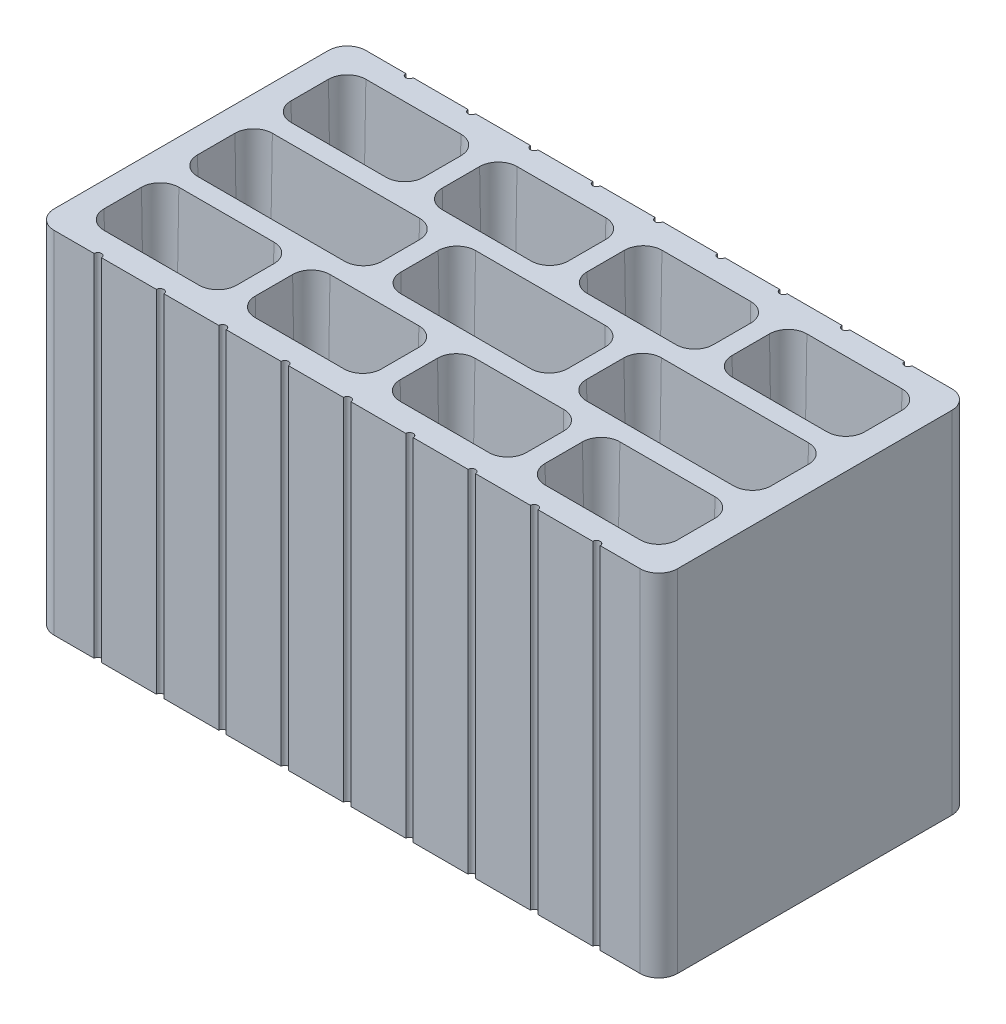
from build123d import *

# Parameters (mm, degrees)
BOSS_EXTRU_1_DEPTH = 28.125
D_POUILLE1_ANGLE   = 1


with BuildPart() as part:
    # Esquisse1 → Boss.-Extru.1 (new body)
    with BuildSketch(Plane(origin=(0, 0, 0), x_dir=(1, 0, 0), z_dir=(0, 1, 0))):
        with BuildLine():
            Line((1.5, 0), (4.7, 0))
            ThreePointArc((4.7, 0), (5, 0.3), (5.3, 0))
            Line((5.3, 0), (9.7, 0))
            ThreePointArc((9.7, 0), (10, 0.3), (10.3, 0))
            Line((10.3, 0), (14.7, 0))
            ThreePointArc((14.7, 0), (15, 0.3), (15.3, 0))
            Line((15.3, 0), (19.7, 0))
            ThreePointArc((19.7, 0), (20, 0.3), (20.3, 0))
            Line((20.3, 0), (24.7, 0))
            ThreePointArc((24.7, 0), (25, 0.3), (25.3, 0))
            Line((25.3, 0), (29.7, 0))
            ThreePointArc((29.7, 0), (30, 0.3), (30.3, 0))
            Line((30.3, 0), (34.7, 0))
            ThreePointArc((34.7, 0), (35, 0.3), (35.3, 0))
            Line((35.3, 0), (39.7, 0))
            ThreePointArc((39.7, 0), (40, 0.3), (40.3, 0))
            Line((40.3, 0), (44.7, 0))
            ThreePointArc((44.7, 0), (45, 0.3), (45.3, 0))
            Line((45.3, 0), (48.5, 0))
            ThreePointArc((48.5, 0), (49.560660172, 0.439339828), (50, 1.5))
            Line((50, 1.5), (50, 23.5))
            ThreePointArc((50, 23.5), (49.560660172, 24.560660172), (48.5, 25))
            Line((48.5, 25), (45.3, 25))
            ThreePointArc((45.3, 25), (45, 24.7), (44.7, 25))
            Line((44.7, 25), (40.3, 25))
            ThreePointArc((40.3, 25), (40, 24.7), (39.7, 25))
            Line((39.7, 25), (35.3, 25))
            ThreePointArc((35.3, 25), (35, 24.7), (34.7, 25))
            Line((34.7, 25), (30.3, 25))
            ThreePointArc((30.3, 25), (30, 24.7), (29.7, 25))
            Line((29.7, 25), (25.3, 25))
            ThreePointArc((25.3, 25), (25, 24.7), (24.7, 25))
            Line((24.7, 25), (20.3, 25))
            ThreePointArc((20.3, 25), (20, 24.7), (19.7, 25))
            Line((19.7, 25), (15.3, 25))
            ThreePointArc((15.3, 25), (15, 24.7), (14.7, 25))
            Line((14.7, 25), (10.3, 25))
            ThreePointArc((10.3, 25), (10, 24.7), (9.7, 25))
            Line((9.7, 25), (5.3, 25))
            ThreePointArc((5.3, 25), (5, 24.7), (4.7, 25))
            Line((4.7, 25), (1.5, 25))
            ThreePointArc((1.5, 25), (0.439339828, 24.560660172), (0, 23.5))
            Line((0, 23.5), (0, 1.5))
            ThreePointArc((0, 1.5), (0.439339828, 0.439339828), (1.5, 0))
        make_face()
        with BuildLine():
            Line((3.5, 8), (11.125, 8))
            ThreePointArc((11.125, 8), (12.185660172, 7.560660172), (12.625, 6.5))
            Line((12.625, 6.5), (12.625, 3.5))
            ThreePointArc((12.625, 3.5), (12.185660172, 2.439339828), (11.125, 2))
            Line((11.125, 2), (3.5, 2))
            ThreePointArc((3.5, 2), (2.439339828, 2.439339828), (2, 3.5))
            Line((2, 3.5), (2, 6.5))
            ThreePointArc((2, 6.5), (2.439339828, 7.560660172), (3.5, 8))
        make_face(mode=Mode.SUBTRACT)
        with BuildLine():
            Line((15.625, 8), (22.75, 8))
            ThreePointArc((22.75, 8), (23.810660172, 7.560660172), (24.25, 6.5))
            Line((24.25, 6.5), (24.25, 3.5))
            ThreePointArc((24.25, 3.5), (23.810660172, 2.439339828), (22.75, 2))
            Line((22.75, 2), (15.625, 2))
            ThreePointArc((15.625, 2), (14.564339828, 2.439339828), (14.125, 3.5))
            Line((14.125, 3.5), (14.125, 6.5))
            ThreePointArc((14.125, 6.5), (14.564339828, 7.560660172), (15.625, 8))
        make_face(mode=Mode.SUBTRACT)
        with BuildLine():
            Line((34.375, 17), (27.25, 17))
            ThreePointArc((27.25, 17), (26.189339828, 17.439339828), (25.75, 18.5))
            Line((25.75, 18.5), (25.75, 21.5))
            ThreePointArc((25.75, 21.5), (26.189339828, 22.560660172), (27.25, 23))
            Line((27.25, 23), (34.375, 23))
            ThreePointArc((34.375, 23), (35.435660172, 22.560660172), (35.875, 21.5))
            Line((35.875, 21.5), (35.875, 18.5))
            ThreePointArc((35.875, 18.5), (35.435660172, 17.439339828), (34.375, 17))
        make_face(mode=Mode.SUBTRACT)
        with BuildLine():
            Line((19.8, 15.5), (30.2, 15.5))
            ThreePointArc((30.2, 15.5), (31.260660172, 15.060660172), (31.7, 14))
            Line((31.7, 14), (31.7, 11))
            ThreePointArc((31.7, 11), (31.260660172, 9.939339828), (30.2, 9.5))
            Line((30.2, 9.5), (19.8, 9.5))
            ThreePointArc((19.8, 9.5), (18.739339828, 9.939339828), (18.3, 11))
            Line((18.3, 11), (18.3, 14))
            ThreePointArc((18.3, 14), (18.739339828, 15.060660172), (19.8, 15.5))
        make_face(mode=Mode.SUBTRACT)
        with BuildLine():
            Line((3.5, 15.5), (15.3, 15.5))
            ThreePointArc((15.3, 15.5), (16.360660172, 15.060660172), (16.8, 14))
            Line((16.8, 14), (16.8, 11))
            ThreePointArc((16.8, 11), (16.360660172, 9.939339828), (15.3, 9.5))
            Line((15.3, 9.5), (3.5, 9.5))
            ThreePointArc((3.5, 9.5), (2.439339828, 9.939339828), (2, 11))
            Line((2, 11), (2, 14))
            ThreePointArc((2, 14), (2.439339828, 15.060660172), (3.5, 15.5))
        make_face(mode=Mode.SUBTRACT)
        with BuildLine():
            Line((46.5, 17), (38.875, 17))
            ThreePointArc((38.875, 17), (37.814339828, 17.439339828), (37.375, 18.5))
            Line((37.375, 18.5), (37.375, 21.5))
            ThreePointArc((37.375, 21.5), (37.814339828, 22.560660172), (38.875, 23))
            Line((38.875, 23), (46.5, 23))
            ThreePointArc((46.5, 23), (47.560660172, 22.560660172), (48, 21.5))
            Line((48, 21.5), (48, 18.5))
            ThreePointArc((48, 18.5), (47.560660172, 17.439339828), (46.5, 17))
        make_face(mode=Mode.SUBTRACT)
        with BuildLine():
            Line((24.25, 18.5), (24.25, 21.5))
            ThreePointArc((24.25, 21.5), (23.810660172, 22.560660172), (22.75, 23))
            Line((22.75, 23), (15.625, 23))
            ThreePointArc((15.625, 23), (14.564339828, 22.560660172), (14.125, 21.5))
            Line((14.125, 21.5), (14.125, 18.5))
            ThreePointArc((14.125, 18.5), (14.564339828, 17.439339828), (15.625, 17))
            Line((15.625, 17), (22.75, 17))
            ThreePointArc((22.75, 17), (23.810660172, 17.439339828), (24.25, 18.5))
        make_face(mode=Mode.SUBTRACT)
        with BuildLine():
            Line((12.625, 18.5), (12.625, 21.5))
            ThreePointArc((12.625, 21.5), (12.185660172, 22.560660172), (11.125, 23))
            Line((11.125, 23), (3.5, 23))
            ThreePointArc((3.5, 23), (2.439339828, 22.560660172), (2, 21.5))
            Line((2, 21.5), (2, 18.5))
            ThreePointArc((2, 18.5), (2.439339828, 17.439339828), (3.5, 17))
            Line((3.5, 17), (11.125, 17))
            ThreePointArc((11.125, 17), (12.185660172, 17.439339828), (12.625, 18.5))
        make_face(mode=Mode.SUBTRACT)
        with BuildLine():
            Line((33.2, 14), (33.2, 11))
            ThreePointArc((33.2, 11), (33.639339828, 9.939339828), (34.7, 9.5))
            Line((34.7, 9.5), (46.5, 9.5))
            ThreePointArc((46.5, 9.5), (47.560660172, 9.939339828), (48, 11))
            Line((48, 11), (48, 14))
            ThreePointArc((48, 14), (47.560660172, 15.060660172), (46.5, 15.5))
            Line((46.5, 15.5), (34.7, 15.5))
            ThreePointArc((34.7, 15.5), (33.639339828, 15.060660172), (33.2, 14))
        make_face(mode=Mode.SUBTRACT)
        with BuildLine():
            Line((25.75, 6.5), (25.75, 3.5))
            ThreePointArc((25.75, 3.5), (26.189339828, 2.439339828), (27.25, 2))
            Line((27.25, 2), (34.375, 2))
            ThreePointArc((34.375, 2), (35.435660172, 2.439339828), (35.875, 3.5))
            Line((35.875, 3.5), (35.875, 6.5))
            ThreePointArc((35.875, 6.5), (35.435660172, 7.560660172), (34.375, 8))
            Line((34.375, 8), (27.25, 8))
            ThreePointArc((27.25, 8), (26.189339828, 7.560660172), (25.75, 6.5))
        make_face(mode=Mode.SUBTRACT)
        with BuildLine():
            Line((37.375, 6.5), (37.375, 3.5))
            ThreePointArc((37.375, 3.5), (37.814339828, 2.439339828), (38.875, 2))
            Line((38.875, 2), (46.5, 2))
            ThreePointArc((46.5, 2), (47.560660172, 2.439339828), (48, 3.5))
            Line((48, 3.5), (48, 6.5))
            ThreePointArc((48, 6.5), (47.560660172, 7.560660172), (46.5, 8))
            Line((46.5, 8), (38.875, 8))
            ThreePointArc((38.875, 8), (37.814339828, 7.560660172), (37.375, 6.5))
        make_face(mode=Mode.SUBTRACT)
    extrude(amount=BOSS_EXTRU_1_DEPTH)

    # D_pouille1
    d_pouille1_faces = [part.faces().sort_by_distance(p)[0] for p in [
        (47.560660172, 14.0625, -2.439339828),
        (37.814339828, 14.0625, -2.439339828),
        (35.435660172, 14.0625, -2.439339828),
        (26.189339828, 14.0625, -2.439339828),
        (23.810660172, 14.0625, -2.439339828),
        (14.564339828, 14.0625, -2.439339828),
        (12.185660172, 14.0625, -2.439339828),
        (2.439339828, 14.0625, -2.439339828),
        (2.439339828, 14.0625, -9.939339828),
        (16.360660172, 14.0625, -9.939339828),
        (18.739339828, 14.0625, -9.939339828),
        (31.260660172, 14.0625, -9.939339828),
        (33.639339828, 14.0625, -9.939339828),
        (47.560660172, 14.0625, -9.939339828),
        (47.560660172, 14.0625, -17.439339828),
        (37.814339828, 14.0625, -17.439339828),
        (35.435660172, 14.0625, -17.439339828),
        (26.189339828, 14.0625, -17.439339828),
        (23.810660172, 14.0625, -17.439339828),
        (14.564339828, 14.0625, -17.439339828),
        (12.185660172, 14.0625, -17.439339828),
        (2.439339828, 14.0625, -17.439339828),
        (2.439339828, 14.0625, -15.060660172),
        (2.439339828, 14.0625, -7.560660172),
        (12.185660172, 14.0625, -7.560660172),
        (16.360660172, 14.0625, -15.060660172),
        (14.564339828, 14.0625, -7.560660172),
        (23.810660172, 14.0625, -7.560660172),
        (18.739339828, 14.0625, -15.060660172),
        (31.260660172, 14.0625, -15.060660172),
        (26.189339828, 14.0625, -7.560660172),
        (35.435660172, 14.0625, -7.560660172),
        (47.560660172, 14.0625, -7.560660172),
        (37.814339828, 14.0625, -7.560660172),
        (33.639339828, 14.0625, -15.060660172),
        (47.560660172, 14.0625, -15.060660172),
        (47.560660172, 14.0625, -22.560660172),
        (37.814339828, 14.0625, -22.560660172),
        (35.435660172, 14.0625, -22.560660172),
        (26.189339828, 14.0625, -22.560660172),
        (23.810660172, 14.0625, -22.560660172),
        (14.564339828, 14.0625, -22.560660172),
        (12.185660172, 14.0625, -22.560660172),
        (2.439339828, 14.0625, -22.560660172),
        (19.1875, 14.0625, -23),
        (24.25, 14.0625, -20),
        (30.8125, 14.0625, -23),
        (35.875, 14.0625, -20),
        (14.125, 14.0625, -20),
        (25.75, 14.0625, -20),
        (30.8125, 14.0625, -17),
        (19.1875, 14.0625, -17),
        (42.6875, 14.0625, -2),
        (37.375, 14.0625, -5),
        (30.8125, 14.0625, -2),
        (25.75, 14.0625, -5),
        (40.6, 14.0625, -9.5),
        (33.2, 14.0625, -12.5),
        (42.6875, 14.0625, -17),
        (37.375, 14.0625, -20),
        (18.3, 14.0625, -12.5),
        (25, 14.0625, -9.5),
        (14.125, 14.0625, -5),
        (19.1875, 14.0625, -2),
        (7.3125, 14.0625, -2),
        (2, 14.0625, -5),
        (9.4, 14.0625, -9.5),
        (2, 14.0625, -12.5),
        (7.3125, 14.0625, -17),
        (2, 14.0625, -20),
        (48, 14.0625, -5),
        (42.6875, 14.0625, -8),
        (35.875, 14.0625, -5),
        (30.8125, 14.0625, -8),
        (24.25, 14.0625, -5),
        (19.1875, 14.0625, -8),
        (12.625, 14.0625, -5),
        (7.3125, 14.0625, -8),
        (9.4, 14.0625, -15.5),
        (16.8, 14.0625, -12.5),
        (25, 14.0625, -15.5),
        (31.7, 14.0625, -12.5),
        (40.6, 14.0625, -15.5),
        (48, 14.0625, -12.5),
        (48, 14.0625, -20),
        (42.6875, 14.0625, -23),
        (12.625, 14.0625, -20),
        (7.3125, 14.0625, -23),
    ]]
    draft(d_pouille1_faces, Plane(origin=(40, 28.125, -25), x_dir=(0, 0, 1), z_dir=(0, 1, 0)), D_POUILLE1_ANGLE)


solid = part.part
